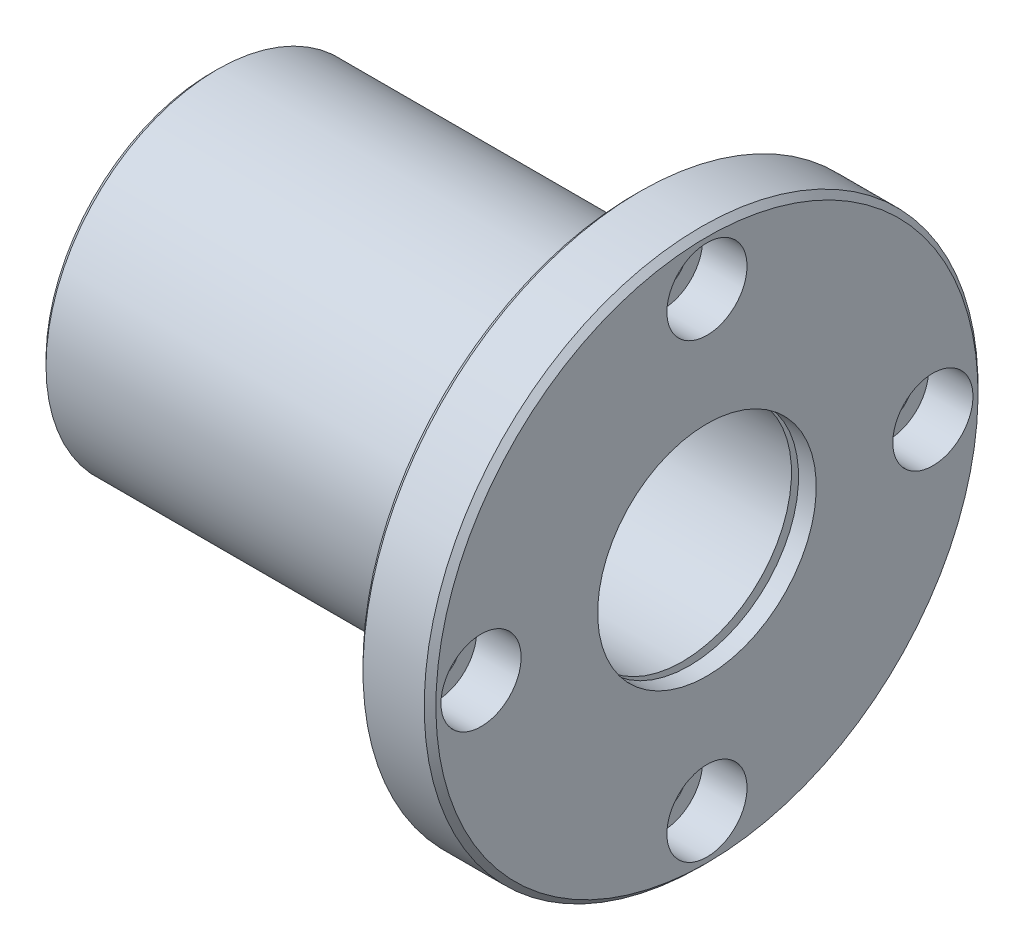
ISO-10303-21;
HEADER;
FILE_DESCRIPTION(('STEP AP214'),'2;1');
FILE_NAME('part.step','',(''),(''),'','','');
FILE_SCHEMA(('AUTOMOTIVE_DESIGN { 1 0 10303 214 1 1 1 1 }'));
ENDSEC;
DATA;
#1=APPLICATION_CONTEXT('core data for automotive mechanical design processes');
#2=APPLICATION_PROTOCOL_DEFINITION('international standard','automotive_design',2000,#1);
#3=PRODUCT_CONTEXT('',#1,'mechanical');
#4=PRODUCT('Part','Part','',(#3));
#5=PRODUCT_RELATED_PRODUCT_CATEGORY('part','',(#4));
#6=PRODUCT_DEFINITION_FORMATION('','',#4);
#7=PRODUCT_DEFINITION_CONTEXT('part definition',#1,'design');
#8=PRODUCT_DEFINITION('design','',#6,#7);
#9=PRODUCT_DEFINITION_SHAPE('','',#8);
#10=(LENGTH_UNIT() NAMED_UNIT(*) SI_UNIT(.MILLI.,.METRE.));
#11=(NAMED_UNIT(*) PLANE_ANGLE_UNIT() SI_UNIT($,.RADIAN.));
#12=(NAMED_UNIT(*) SI_UNIT($,.STERADIAN.) SOLID_ANGLE_UNIT());
#13=UNCERTAINTY_MEASURE_WITH_UNIT(LENGTH_MEASURE(1.E-05),#10,'distance_accuracy_value','');
#14=(GEOMETRIC_REPRESENTATION_CONTEXT(3) GLOBAL_UNCERTAINTY_ASSIGNED_CONTEXT((#13)) GLOBAL_UNIT_ASSIGNED_CONTEXT((#10,
#11,#12)) REPRESENTATION_CONTEXT('',''));
#15=CARTESIAN_POINT('',(0.,0.,0.));
#16=DIRECTION('',(0.,0.,1.));
#17=DIRECTION('',(1.,0.,0.));
#18=AXIS2_PLACEMENT_3D('',#15,#16,#17);
#19=CARTESIAN_POINT('',(0.,19.275,0.));
#20=DIRECTION('',(-1.,0.,0.));
#21=DIRECTION('',(0.,0.,1.));
#22=AXIS2_PLACEMENT_3D('',#19,#20,#21);
#23=PLANE('',#22);
#24=CARTESIAN_POINT('',(0.,0.,0.));
#25=DIRECTION('',(-1.,0.,0.));
#26=DIRECTION('',(0.,1.,0.));
#27=AXIS2_PLACEMENT_3D('',#24,#25,#26);
#28=CIRCLE('',#27,15.85);
#29=CARTESIAN_POINT('',(0.,-15.85,0.));
#30=VERTEX_POINT('',#29);
#31=EDGE_CURVE('E224',#30,#30,#28,.T.);
#32=ORIENTED_EDGE('',*,*,#31,.F.);
#33=EDGE_LOOP('',(#32));
#34=FACE_BOUND('',#33,.T.);
#35=CARTESIAN_POINT('',(0.,0.,0.));
#36=DIRECTION('',(-1.,0.,0.));
#37=DIRECTION('',(0.,1.,0.));
#38=AXIS2_PLACEMENT_3D('',#35,#36,#37);
#39=CIRCLE('',#38,22.7);
#40=CARTESIAN_POINT('',(0.,-22.7,0.));
#41=VERTEX_POINT('',#40);
#42=EDGE_CURVE('E210',#41,#41,#39,.T.);
#43=ORIENTED_EDGE('',*,*,#42,.T.);
#44=EDGE_LOOP('',(#43));
#45=FACE_BOUND('',#44,.T.);
#46=ADVANCED_FACE('F16',(#34,#45),#23,.T.);
#47=CARTESIAN_POINT('',(58.,30.3749155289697,0.));
#48=DIRECTION('',(-1.,0.,0.));
#49=DIRECTION('',(0.,0.,1.));
#50=AXIS2_PLACEMENT_3D('',#47,#48,#49);
#51=PLANE('',#50);
#52=CARTESIAN_POINT('',(58.,0.,0.));
#53=DIRECTION('',(-1.,0.,0.));
#54=DIRECTION('',(0.,1.,0.));
#55=AXIS2_PLACEMENT_3D('',#52,#53,#54);
#56=CIRCLE('',#55,23.5498310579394);
#57=CARTESIAN_POINT('',(58.,23.5498310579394,0.));
#58=VERTEX_POINT('',#57);
#59=CARTESIAN_POINT('',(58.,0.,-23.5498310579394));
#60=VERTEX_POINT('',#59);
#61=EDGE_CURVE('E238',#58,#60,#56,.T.);
#62=ORIENTED_EDGE('',*,*,#61,.F.);
#63=CARTESIAN_POINT('',(58.,0.,0.));
#64=DIRECTION('',(-1.,0.,0.));
#65=DIRECTION('',(0.,1.,0.));
#66=AXIS2_PLACEMENT_3D('',#63,#64,#65);
#67=CIRCLE('',#66,23.5498310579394);
#68=EDGE_CURVE('E232',#60,#58,#67,.T.);
#69=ORIENTED_EDGE('',*,*,#68,.F.);
#70=EDGE_LOOP('',(#62,#69));
#71=FACE_BOUND('',#70,.T.);
#72=CARTESIAN_POINT('',(58.,31.,0.));
#73=DIRECTION('',(1.,0.,0.));
#74=DIRECTION('',(0.,1.,0.));
#75=AXIS2_PLACEMENT_3D('',#72,#73,#74);
#76=CIRCLE('',#75,3.3);
#77=CARTESIAN_POINT('',(58.,27.7,0.));
#78=VERTEX_POINT('',#77);
#79=EDGE_CURVE('E292',#78,#78,#76,.T.);
#80=ORIENTED_EDGE('',*,*,#79,.T.);
#81=EDGE_LOOP('',(#80));
#82=FACE_BOUND('',#81,.T.);
#83=CARTESIAN_POINT('',(58.,-31.,0.));
#84=DIRECTION('',(1.,0.,0.));
#85=DIRECTION('',(0.,1.,0.));
#86=AXIS2_PLACEMENT_3D('',#83,#84,#85);
#87=CIRCLE('',#86,3.3);
#88=CARTESIAN_POINT('',(58.,-34.3,0.));
#89=VERTEX_POINT('',#88);
#90=EDGE_CURVE('E361',#89,#89,#87,.T.);
#91=ORIENTED_EDGE('',*,*,#90,.T.);
#92=EDGE_LOOP('',(#91));
#93=FACE_BOUND('',#92,.T.);
#94=CARTESIAN_POINT('',(58.,0.,31.));
#95=DIRECTION('',(1.,0.,0.));
#96=DIRECTION('',(0.,0.,-1.));
#97=AXIS2_PLACEMENT_3D('',#94,#95,#96);
#98=CIRCLE('',#97,3.3);
#99=CARTESIAN_POINT('',(58.,0.,34.3));
#100=VERTEX_POINT('',#99);
#101=EDGE_CURVE('E274',#100,#100,#98,.T.);
#102=ORIENTED_EDGE('',*,*,#101,.T.);
#103=EDGE_LOOP('',(#102));
#104=FACE_BOUND('',#103,.T.);
#105=CARTESIAN_POINT('',(58.,0.,-31.));
#106=DIRECTION('',(1.,0.,0.));
#107=DIRECTION('',(0.,0.,-1.));
#108=AXIS2_PLACEMENT_3D('',#105,#106,#107);
#109=CIRCLE('',#108,3.3);
#110=CARTESIAN_POINT('',(58.,0.,-27.7));
#111=VERTEX_POINT('',#110);
#112=EDGE_CURVE('E382',#111,#111,#109,.T.);
#113=ORIENTED_EDGE('',*,*,#112,.T.);
#114=EDGE_LOOP('',(#113));
#115=FACE_BOUND('',#114,.T.);
#116=CARTESIAN_POINT('',(58.,0.,0.));
#117=DIRECTION('',(-1.,0.,0.));
#118=DIRECTION('',(0.,1.,0.));
#119=AXIS2_PLACEMENT_3D('',#116,#117,#118);
#120=CIRCLE('',#119,37.2);
#121=CARTESIAN_POINT('',(58.,-37.2,0.));
#122=VERTEX_POINT('',#121);
#123=EDGE_CURVE('E266',#122,#122,#120,.T.);
#124=ORIENTED_EDGE('',*,*,#123,.T.);
#125=EDGE_LOOP('',(#124));
#126=FACE_BOUND('',#125,.T.);
#127=ADVANCED_FACE('F414',(#71,#82,#93,#104,#115,#126),#51,.T.);
#128=CARTESIAN_POINT('',(68.,26.1,0.));
#129=DIRECTION('',(1.,0.,0.));
#130=DIRECTION('',(0.,1.,0.));
#131=AXIS2_PLACEMENT_3D('',#128,#129,#130);
#132=PLANE('',#131);
#133=CARTESIAN_POINT('',(68.,31.,0.));
#134=DIRECTION('',(-1.,0.,0.));
#135=DIRECTION('',(0.,1.,0.));
#136=AXIS2_PLACEMENT_3D('',#133,#134,#135);
#137=CIRCLE('',#136,5.5);
#138=CARTESIAN_POINT('',(68.,25.5,0.));
#139=VERTEX_POINT('',#138);
#140=EDGE_CURVE('E358',#139,#139,#137,.T.);
#141=ORIENTED_EDGE('',*,*,#140,.T.);
#142=EDGE_LOOP('',(#141));
#143=FACE_BOUND('',#142,.T.);
#144=CARTESIAN_POINT('',(68.,-31.,0.));
#145=DIRECTION('',(-1.,0.,0.));
#146=DIRECTION('',(0.,1.,0.));
#147=AXIS2_PLACEMENT_3D('',#144,#145,#146);
#148=CIRCLE('',#147,5.5);
#149=CARTESIAN_POINT('',(68.,-36.5,0.));
#150=VERTEX_POINT('',#149);
#151=EDGE_CURVE('E347',#150,#150,#148,.T.);
#152=ORIENTED_EDGE('',*,*,#151,.T.);
#153=EDGE_LOOP('',(#152));
#154=FACE_BOUND('',#153,.T.);
#155=CARTESIAN_POINT('',(68.,0.,31.));
#156=DIRECTION('',(-1.,0.,0.));
#157=DIRECTION('',(0.,0.,-1.));
#158=AXIS2_PLACEMENT_3D('',#155,#156,#157);
#159=CIRCLE('',#158,5.5);
#160=CARTESIAN_POINT('',(68.,0.,36.5));
#161=VERTEX_POINT('',#160);
#162=EDGE_CURVE('E380',#161,#161,#159,.T.);
#163=ORIENTED_EDGE('',*,*,#162,.T.);
#164=EDGE_LOOP('',(#163));
#165=FACE_BOUND('',#164,.T.);
#166=CARTESIAN_POINT('',(68.,0.,-31.));
#167=DIRECTION('',(-1.,0.,0.));
#168=DIRECTION('',(0.,0.,-1.));
#169=AXIS2_PLACEMENT_3D('',#166,#167,#168);
#170=CIRCLE('',#169,5.5);
#171=CARTESIAN_POINT('',(68.,0.,-25.5));
#172=VERTEX_POINT('',#171);
#173=EDGE_CURVE('E10',#172,#172,#170,.T.);
#174=ORIENTED_EDGE('',*,*,#173,.T.);
#175=EDGE_LOOP('',(#174));
#176=FACE_BOUND('',#175,.T.);
#177=CARTESIAN_POINT('',(68.,0.,0.));
#178=DIRECTION('',(-1.,0.,0.));
#179=DIRECTION('',(0.,1.,0.));
#180=AXIS2_PLACEMENT_3D('',#177,#178,#179);
#181=CIRCLE('',#180,15.);
#182=CARTESIAN_POINT('',(68.,-15.,0.));
#183=VERTEX_POINT('',#182);
#184=EDGE_CURVE('E305',#183,#183,#181,.T.);
#185=ORIENTED_EDGE('',*,*,#184,.T.);
#186=EDGE_LOOP('',(#185));
#187=FACE_BOUND('',#186,.T.);
#188=CARTESIAN_POINT('',(68.,0.,0.));
#189=DIRECTION('',(-1.,0.,0.));
#190=DIRECTION('',(0.,1.,0.));
#191=AXIS2_PLACEMENT_3D('',#188,#189,#190);
#192=CIRCLE('',#191,37.2);
#193=CARTESIAN_POINT('',(68.,-37.2,0.));
#194=VERTEX_POINT('',#193);
#195=EDGE_CURVE('E260',#194,#194,#192,.T.);
#196=ORIENTED_EDGE('',*,*,#195,.F.);
#197=EDGE_LOOP('',(#196));
#198=FACE_BOUND('',#197,.T.);
#199=ADVANCED_FACE('F419',(#143,#154,#165,#176,#187,#198),#132,.T.);
#200=CARTESIAN_POINT('',(65.5714285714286,16.175,0.));
#201=DIRECTION('',(-1.,0.,0.));
#202=DIRECTION('',(0.,0.,1.));
#203=AXIS2_PLACEMENT_3D('',#200,#201,#202);
#204=PLANE('',#203);
#205=CARTESIAN_POINT('',(65.5714285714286,0.,0.));
#206=DIRECTION('',(-1.,0.,0.));
#207=DIRECTION('',(0.,1.,0.));
#208=AXIS2_PLACEMENT_3D('',#205,#206,#207);
#209=CIRCLE('',#208,15.);
#210=CARTESIAN_POINT('',(65.5714285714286,-15.,0.));
#211=VERTEX_POINT('',#210);
#212=EDGE_CURVE('E255',#211,#211,#209,.T.);
#213=ORIENTED_EDGE('',*,*,#212,.F.);
#214=EDGE_LOOP('',(#213));
#215=FACE_BOUND('',#214,.T.);
#216=CARTESIAN_POINT('',(65.5714285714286,0.,0.));
#217=DIRECTION('',(-1.,0.,0.));
#218=DIRECTION('',(0.,1.,0.));
#219=AXIS2_PLACEMENT_3D('',#216,#217,#218);
#220=CIRCLE('',#219,17.35);
#221=CARTESIAN_POINT('',(65.5714285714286,-17.35,0.));
#222=VERTEX_POINT('',#221);
#223=EDGE_CURVE('E225',#222,#222,#220,.T.);
#224=ORIENTED_EDGE('',*,*,#223,.T.);
#225=EDGE_LOOP('',(#224));
#226=FACE_BOUND('',#225,.T.);
#227=ADVANCED_FACE('F893',(#215,#226),#204,.T.);
#228=CARTESIAN_POINT('',(64.6,16.175,0.));
#229=DIRECTION('',(1.,0.,0.));
#230=DIRECTION('',(0.,1.,0.));
#231=AXIS2_PLACEMENT_3D('',#228,#229,#230);
#232=PLANE('',#231);
#233=CARTESIAN_POINT('',(64.6,0.,0.));
#234=DIRECTION('',(-1.,0.,0.));
#235=DIRECTION('',(0.,1.,0.));
#236=AXIS2_PLACEMENT_3D('',#233,#234,#235);
#237=CIRCLE('',#236,15.);
#238=CARTESIAN_POINT('',(64.6,-15.,0.));
#239=VERTEX_POINT('',#238);
#240=EDGE_CURVE('E284',#239,#239,#237,.T.);
#241=ORIENTED_EDGE('',*,*,#240,.T.);
#242=EDGE_LOOP('',(#241));
#243=FACE_BOUND('',#242,.T.);
#244=CARTESIAN_POINT('',(64.6,0.,0.));
#245=DIRECTION('',(-1.,0.,0.));
#246=DIRECTION('',(0.,1.,0.));
#247=AXIS2_PLACEMENT_3D('',#244,#245,#246);
#248=CIRCLE('',#247,17.35);
#249=CARTESIAN_POINT('',(64.6,-17.35,0.));
#250=VERTEX_POINT('',#249);
#251=EDGE_CURVE('E308',#250,#250,#248,.T.);
#252=ORIENTED_EDGE('',*,*,#251,.F.);
#253=EDGE_LOOP('',(#252));
#254=FACE_BOUND('',#253,.T.);
#255=ADVANCED_FACE('F881',(#243,#254),#232,.T.);
#256=CARTESIAN_POINT('',(3.4,16.175,0.));
#257=DIRECTION('',(-1.,0.,0.));
#258=DIRECTION('',(0.,0.,1.));
#259=AXIS2_PLACEMENT_3D('',#256,#257,#258);
#260=PLANE('',#259);
#261=CARTESIAN_POINT('',(3.4,0.,0.));
#262=DIRECTION('',(-1.,0.,0.));
#263=DIRECTION('',(0.,1.,0.));
#264=AXIS2_PLACEMENT_3D('',#261,#262,#263);
#265=CIRCLE('',#264,15.);
#266=CARTESIAN_POINT('',(3.4,-15.,0.));
#267=VERTEX_POINT('',#266);
#268=EDGE_CURVE('E228',#267,#267,#265,.T.);
#269=ORIENTED_EDGE('',*,*,#268,.F.);
#270=EDGE_LOOP('',(#269));
#271=FACE_BOUND('',#270,.T.);
#272=CARTESIAN_POINT('',(3.4,0.,0.));
#273=DIRECTION('',(-1.,0.,0.));
#274=DIRECTION('',(0.,1.,0.));
#275=AXIS2_PLACEMENT_3D('',#272,#273,#274);
#276=CIRCLE('',#275,17.35);
#277=CARTESIAN_POINT('',(3.4,-17.35,0.));
#278=VERTEX_POINT('',#277);
#279=EDGE_CURVE('E243',#278,#278,#276,.T.);
#280=ORIENTED_EDGE('',*,*,#279,.T.);
#281=EDGE_LOOP('',(#280));
#282=FACE_BOUND('',#281,.T.);
#283=ADVANCED_FACE('F684',(#271,#282),#260,.T.);
#284=CARTESIAN_POINT('',(2.42857142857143,16.6,0.));
#285=DIRECTION('',(1.,0.,0.));
#286=DIRECTION('',(0.,1.,0.));
#287=AXIS2_PLACEMENT_3D('',#284,#285,#286);
#288=PLANE('',#287);
#289=CARTESIAN_POINT('',(2.42857142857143,0.,0.));
#290=DIRECTION('',(-1.,0.,0.));
#291=DIRECTION('',(0.,1.,0.));
#292=AXIS2_PLACEMENT_3D('',#289,#290,#291);
#293=CIRCLE('',#292,15.85);
#294=CARTESIAN_POINT('',(2.42857142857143,-15.85,0.));
#295=VERTEX_POINT('',#294);
#296=EDGE_CURVE('E223',#295,#295,#293,.T.);
#297=ORIENTED_EDGE('',*,*,#296,.T.);
#298=EDGE_LOOP('',(#297));
#299=FACE_BOUND('',#298,.T.);
#300=CARTESIAN_POINT('',(2.42857142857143,0.,0.));
#301=DIRECTION('',(-1.,0.,0.));
#302=DIRECTION('',(0.,1.,0.));
#303=AXIS2_PLACEMENT_3D('',#300,#301,#302);
#304=CIRCLE('',#303,17.35);
#305=CARTESIAN_POINT('',(2.42857142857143,-17.35,0.));
#306=VERTEX_POINT('',#305);
#307=EDGE_CURVE('E244',#306,#306,#304,.T.);
#308=ORIENTED_EDGE('',*,*,#307,.F.);
#309=EDGE_LOOP('',(#308));
#310=FACE_BOUND('',#309,.T.);
#311=ADVANCED_FACE('F679',(#299,#310),#288,.T.);
#312=CARTESIAN_POINT('',(61.9,35.4,0.));
#313=DIRECTION('',(-1.,0.,0.));
#314=DIRECTION('',(0.,0.,1.));
#315=AXIS2_PLACEMENT_3D('',#312,#313,#314);
#316=PLANE('',#315);
#317=CARTESIAN_POINT('',(61.9,31.,0.));
#318=DIRECTION('',(-1.,0.,0.));
#319=DIRECTION('',(0.,1.,0.));
#320=AXIS2_PLACEMENT_3D('',#317,#318,#319);
#321=CIRCLE('',#320,3.3);
#322=CARTESIAN_POINT('',(61.9,27.7,0.));
#323=VERTEX_POINT('',#322);
#324=EDGE_CURVE('E343',#323,#323,#321,.T.);
#325=ORIENTED_EDGE('',*,*,#324,.T.);
#326=EDGE_LOOP('',(#325));
#327=FACE_BOUND('',#326,.T.);
#328=CARTESIAN_POINT('',(61.9,31.,0.));
#329=DIRECTION('',(-1.,0.,0.));
#330=DIRECTION('',(0.,1.,0.));
#331=AXIS2_PLACEMENT_3D('',#328,#329,#330);
#332=CIRCLE('',#331,5.5);
#333=CARTESIAN_POINT('',(61.9,25.5,0.));
#334=VERTEX_POINT('',#333);
#335=EDGE_CURVE('E350',#334,#334,#332,.T.);
#336=ORIENTED_EDGE('',*,*,#335,.F.);
#337=EDGE_LOOP('',(#336));
#338=FACE_BOUND('',#337,.T.);
#339=ADVANCED_FACE('F601',(#327,#338),#316,.F.);
#340=CARTESIAN_POINT('',(61.9,-26.6,0.));
#341=DIRECTION('',(-1.,0.,0.));
#342=DIRECTION('',(0.,0.,1.));
#343=AXIS2_PLACEMENT_3D('',#340,#341,#342);
#344=PLANE('',#343);
#345=CARTESIAN_POINT('',(61.9,-31.,0.));
#346=DIRECTION('',(-1.,0.,0.));
#347=DIRECTION('',(0.,1.,0.));
#348=AXIS2_PLACEMENT_3D('',#345,#346,#347);
#349=CIRCLE('',#348,3.3);
#350=CARTESIAN_POINT('',(61.9,-34.3,0.));
#351=VERTEX_POINT('',#350);
#352=EDGE_CURVE('E319',#351,#351,#349,.T.);
#353=ORIENTED_EDGE('',*,*,#352,.T.);
#354=EDGE_LOOP('',(#353));
#355=FACE_BOUND('',#354,.T.);
#356=CARTESIAN_POINT('',(61.9,-31.,0.));
#357=DIRECTION('',(-1.,0.,0.));
#358=DIRECTION('',(0.,1.,0.));
#359=AXIS2_PLACEMENT_3D('',#356,#357,#358);
#360=CIRCLE('',#359,5.5);
#361=CARTESIAN_POINT('',(61.9,-36.5,0.));
#362=VERTEX_POINT('',#361);
#363=EDGE_CURVE('E322',#362,#362,#360,.T.);
#364=ORIENTED_EDGE('',*,*,#363,.F.);
#365=EDGE_LOOP('',(#364));
#366=FACE_BOUND('',#365,.T.);
#367=ADVANCED_FACE('F595',(#355,#366),#344,.F.);
#368=CARTESIAN_POINT('',(61.9,0.,26.6));
#369=DIRECTION('',(-1.,0.,0.));
#370=DIRECTION('',(0.,0.,1.));
#371=AXIS2_PLACEMENT_3D('',#368,#369,#370);
#372=PLANE('',#371);
#373=CARTESIAN_POINT('',(61.9,0.,31.));
#374=DIRECTION('',(-1.,0.,0.));
#375=DIRECTION('',(0.,0.,-1.));
#376=AXIS2_PLACEMENT_3D('',#373,#374,#375);
#377=CIRCLE('',#376,3.3);
#378=CARTESIAN_POINT('',(61.9,0.,34.3));
#379=VERTEX_POINT('',#378);
#380=EDGE_CURVE('E250',#379,#379,#377,.T.);
#381=ORIENTED_EDGE('',*,*,#380,.T.);
#382=EDGE_LOOP('',(#381));
#383=FACE_BOUND('',#382,.T.);
#384=CARTESIAN_POINT('',(61.9,0.,31.));
#385=DIRECTION('',(-1.,0.,0.));
#386=DIRECTION('',(0.,0.,-1.));
#387=AXIS2_PLACEMENT_3D('',#384,#385,#386);
#388=CIRCLE('',#387,5.5);
#389=CARTESIAN_POINT('',(61.9,0.,36.5));
#390=VERTEX_POINT('',#389);
#391=EDGE_CURVE('E253',#390,#390,#388,.T.);
#392=ORIENTED_EDGE('',*,*,#391,.F.);
#393=EDGE_LOOP('',(#392));
#394=FACE_BOUND('',#393,.T.);
#395=ADVANCED_FACE('F409',(#383,#394),#372,.F.);
#396=CARTESIAN_POINT('',(61.9,0.,-35.4));
#397=DIRECTION('',(-1.,0.,0.));
#398=DIRECTION('',(0.,0.,1.));
#399=AXIS2_PLACEMENT_3D('',#396,#397,#398);
#400=PLANE('',#399);
#401=CARTESIAN_POINT('',(61.9,0.,-31.));
#402=DIRECTION('',(-1.,0.,0.));
#403=DIRECTION('',(0.,0.,-1.));
#404=AXIS2_PLACEMENT_3D('',#401,#402,#403);
#405=CIRCLE('',#404,3.3);
#406=CARTESIAN_POINT('',(61.9,0.,-27.7));
#407=VERTEX_POINT('',#406);
#408=EDGE_CURVE('E214',#407,#407,#405,.T.);
#409=ORIENTED_EDGE('',*,*,#408,.T.);
#410=EDGE_LOOP('',(#409));
#411=FACE_BOUND('',#410,.T.);
#412=CARTESIAN_POINT('',(61.9,0.,-31.));
#413=DIRECTION('',(-1.,0.,0.));
#414=DIRECTION('',(0.,0.,-1.));
#415=AXIS2_PLACEMENT_3D('',#412,#413,#414);
#416=CIRCLE('',#415,5.5);
#417=CARTESIAN_POINT('',(61.9,0.,-25.5));
#418=VERTEX_POINT('',#417);
#419=EDGE_CURVE('E216',#418,#418,#416,.T.);
#420=ORIENTED_EDGE('',*,*,#419,.F.);
#421=EDGE_LOOP('',(#420));
#422=FACE_BOUND('',#421,.T.);
#423=ADVANCED_FACE('F399',(#411,#422),#400,.F.);
#424=CARTESIAN_POINT('',(64.95,0.,-31.));
#425=DIRECTION('',(1.,0.,0.));
#426=DIRECTION('',(0.,0.,-1.));
#427=AXIS2_PLACEMENT_3D('',#424,#425,#426);
#428=CYLINDRICAL_SURFACE('',#427,5.5);
#429=ORIENTED_EDGE('',*,*,#419,.T.);
#430=DIRECTION('',(1.,0.,0.));
#431=VECTOR('',#430,1.);
#432=CARTESIAN_POINT('',(64.95,0.,-25.5));
#433=LINE('',#432,#431);
#434=EDGE_CURVE('E19',#418,#172,#433,.T.);
#435=ORIENTED_EDGE('',*,*,#434,.T.);
#436=ORIENTED_EDGE('',*,*,#173,.F.);
#437=ORIENTED_EDGE('',*,*,#434,.F.);
#438=EDGE_LOOP('',(#429,#435,#436,#437));
#439=FACE_BOUND('',#438,.T.);
#440=ADVANCED_FACE('F396',(#439),#428,.F.);
#441=CARTESIAN_POINT('',(59.95,0.,-31.));
#442=DIRECTION('',(1.,0.,0.));
#443=DIRECTION('',(0.,0.,-1.));
#444=AXIS2_PLACEMENT_3D('',#441,#442,#443);
#445=CYLINDRICAL_SURFACE('',#444,3.3);
#446=ORIENTED_EDGE('',*,*,#112,.F.);
#447=DIRECTION('',(1.,0.,0.));
#448=VECTOR('',#447,1.);
#449=CARTESIAN_POINT('',(59.95,0.,-27.7));
#450=LINE('',#449,#448);
#451=EDGE_CURVE('E217',#111,#407,#450,.T.);
#452=ORIENTED_EDGE('',*,*,#451,.T.);
#453=ORIENTED_EDGE('',*,*,#408,.F.);
#454=ORIENTED_EDGE('',*,*,#451,.F.);
#455=EDGE_LOOP('',(#446,#452,#453,#454));
#456=FACE_BOUND('',#455,.T.);
#457=ADVANCED_FACE('F398',(#456),#445,.F.);
#458=CARTESIAN_POINT('',(64.95,0.,31.));
#459=DIRECTION('',(1.,0.,0.));
#460=DIRECTION('',(0.,0.,-1.));
#461=AXIS2_PLACEMENT_3D('',#458,#459,#460);
#462=CYLINDRICAL_SURFACE('',#461,5.5);
#463=ORIENTED_EDGE('',*,*,#391,.T.);
#464=DIRECTION('',(1.,0.,0.));
#465=VECTOR('',#464,1.);
#466=CARTESIAN_POINT('',(64.95,0.,36.5));
#467=LINE('',#466,#465);
#468=EDGE_CURVE('E376',#390,#161,#467,.T.);
#469=ORIENTED_EDGE('',*,*,#468,.T.);
#470=ORIENTED_EDGE('',*,*,#162,.F.);
#471=ORIENTED_EDGE('',*,*,#468,.F.);
#472=EDGE_LOOP('',(#463,#469,#470,#471));
#473=FACE_BOUND('',#472,.T.);
#474=ADVANCED_FACE('F406',(#473),#462,.F.);
#475=CARTESIAN_POINT('',(59.95,0.,31.));
#476=DIRECTION('',(1.,0.,0.));
#477=DIRECTION('',(0.,0.,-1.));
#478=AXIS2_PLACEMENT_3D('',#475,#476,#477);
#479=CYLINDRICAL_SURFACE('',#478,3.3);
#480=ORIENTED_EDGE('',*,*,#101,.F.);
#481=DIRECTION('',(1.,0.,0.));
#482=VECTOR('',#481,1.);
#483=CARTESIAN_POINT('',(59.95,0.,34.3));
#484=LINE('',#483,#482);
#485=EDGE_CURVE('E254',#100,#379,#484,.T.);
#486=ORIENTED_EDGE('',*,*,#485,.T.);
#487=ORIENTED_EDGE('',*,*,#380,.F.);
#488=ORIENTED_EDGE('',*,*,#485,.F.);
#489=EDGE_LOOP('',(#480,#486,#487,#488));
#490=FACE_BOUND('',#489,.T.);
#491=ADVANCED_FACE('F806',(#490),#479,.F.);
#492=CARTESIAN_POINT('',(64.95,-31.,0.));
#493=DIRECTION('',(1.,0.,0.));
#494=DIRECTION('',(0.,1.,0.));
#495=AXIS2_PLACEMENT_3D('',#492,#493,#494);
#496=CYLINDRICAL_SURFACE('',#495,5.5);
#497=ORIENTED_EDGE('',*,*,#363,.T.);
#498=DIRECTION('',(1.,0.,0.));
#499=VECTOR('',#498,1.);
#500=CARTESIAN_POINT('',(64.95,-36.5,0.));
#501=LINE('',#500,#499);
#502=EDGE_CURVE('E330',#362,#150,#501,.T.);
#503=ORIENTED_EDGE('',*,*,#502,.T.);
#504=ORIENTED_EDGE('',*,*,#151,.F.);
#505=ORIENTED_EDGE('',*,*,#502,.F.);
#506=EDGE_LOOP('',(#497,#503,#504,#505));
#507=FACE_BOUND('',#506,.T.);
#508=ADVANCED_FACE('F751',(#507),#496,.F.);
#509=CARTESIAN_POINT('',(59.95,-31.,0.));
#510=DIRECTION('',(1.,0.,0.));
#511=DIRECTION('',(0.,1.,0.));
#512=AXIS2_PLACEMENT_3D('',#509,#510,#511);
#513=CYLINDRICAL_SURFACE('',#512,3.3);
#514=ORIENTED_EDGE('',*,*,#90,.F.);
#515=DIRECTION('',(1.,0.,0.));
#516=VECTOR('',#515,1.);
#517=CARTESIAN_POINT('',(59.95,-34.3,0.));
#518=LINE('',#517,#516);
#519=EDGE_CURVE('E323',#89,#351,#518,.T.);
#520=ORIENTED_EDGE('',*,*,#519,.T.);
#521=ORIENTED_EDGE('',*,*,#352,.F.);
#522=ORIENTED_EDGE('',*,*,#519,.F.);
#523=EDGE_LOOP('',(#514,#520,#521,#522));
#524=FACE_BOUND('',#523,.T.);
#525=ADVANCED_FACE('F745',(#524),#513,.F.);
#526=CARTESIAN_POINT('',(64.95,31.,0.));
#527=DIRECTION('',(1.,0.,0.));
#528=DIRECTION('',(0.,1.,0.));
#529=AXIS2_PLACEMENT_3D('',#526,#527,#528);
#530=CYLINDRICAL_SURFACE('',#529,5.5);
#531=ORIENTED_EDGE('',*,*,#335,.T.);
#532=DIRECTION('',(1.,0.,0.));
#533=VECTOR('',#532,1.);
#534=CARTESIAN_POINT('',(64.95,25.5,0.));
#535=LINE('',#534,#533);
#536=EDGE_CURVE('E354',#334,#139,#535,.T.);
#537=ORIENTED_EDGE('',*,*,#536,.T.);
#538=ORIENTED_EDGE('',*,*,#140,.F.);
#539=ORIENTED_EDGE('',*,*,#536,.F.);
#540=EDGE_LOOP('',(#531,#537,#538,#539));
#541=FACE_BOUND('',#540,.T.);
#542=ADVANCED_FACE('F750',(#541),#530,.F.);
#543=CARTESIAN_POINT('',(59.95,31.,0.));
#544=DIRECTION('',(1.,0.,0.));
#545=DIRECTION('',(0.,1.,0.));
#546=AXIS2_PLACEMENT_3D('',#543,#544,#545);
#547=CYLINDRICAL_SURFACE('',#546,3.3);
#548=ORIENTED_EDGE('',*,*,#79,.F.);
#549=DIRECTION('',(1.,0.,0.));
#550=VECTOR('',#549,1.);
#551=CARTESIAN_POINT('',(59.95,27.7,0.));
#552=LINE('',#551,#550);
#553=EDGE_CURVE('E296',#78,#323,#552,.T.);
#554=ORIENTED_EDGE('',*,*,#553,.T.);
#555=ORIENTED_EDGE('',*,*,#324,.F.);
#556=ORIENTED_EDGE('',*,*,#553,.F.);
#557=EDGE_LOOP('',(#548,#554,#555,#556));
#558=FACE_BOUND('',#557,.T.);
#559=ADVANCED_FACE('F761',(#558),#547,.F.);
#560=CARTESIAN_POINT('',(1.21428571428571,0.,0.));
#561=DIRECTION('',(1.,0.,0.));
#562=DIRECTION('',(0.,1.,0.));
#563=AXIS2_PLACEMENT_3D('',#560,#561,#562);
#564=CYLINDRICAL_SURFACE('',#563,15.85);
#565=ORIENTED_EDGE('',*,*,#31,.T.);
#566=DIRECTION('',(1.,0.,0.));
#567=VECTOR('',#566,1.);
#568=CARTESIAN_POINT('',(1.21428571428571,-15.85,0.));
#569=LINE('',#568,#567);
#570=EDGE_CURVE('E219',#30,#295,#569,.T.);
#571=ORIENTED_EDGE('',*,*,#570,.T.);
#572=ORIENTED_EDGE('',*,*,#296,.F.);
#573=ORIENTED_EDGE('',*,*,#570,.F.);
#574=EDGE_LOOP('',(#565,#571,#572,#573));
#575=FACE_BOUND('',#574,.T.);
#576=ADVANCED_FACE('F658',(#575),#564,.F.);
#577=CARTESIAN_POINT('',(2.91428571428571,0.,0.));
#578=DIRECTION('',(1.,0.,0.));
#579=DIRECTION('',(0.,1.,0.));
#580=AXIS2_PLACEMENT_3D('',#577,#578,#579);
#581=CYLINDRICAL_SURFACE('',#580,17.35);
#582=ORIENTED_EDGE('',*,*,#307,.T.);
#583=DIRECTION('',(1.,0.,0.));
#584=VECTOR('',#583,1.);
#585=CARTESIAN_POINT('',(2.91428571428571,-17.35,0.));
#586=LINE('',#585,#584);
#587=EDGE_CURVE('E239',#306,#278,#586,.T.);
#588=ORIENTED_EDGE('',*,*,#587,.T.);
#589=ORIENTED_EDGE('',*,*,#279,.F.);
#590=ORIENTED_EDGE('',*,*,#587,.F.);
#591=EDGE_LOOP('',(#582,#588,#589,#590));
#592=FACE_BOUND('',#591,.T.);
#593=ADVANCED_FACE('F652',(#592),#581,.F.);
#594=CARTESIAN_POINT('',(34.,0.,0.));
#595=DIRECTION('',(1.,0.,0.));
#596=DIRECTION('',(0.,1.,0.));
#597=AXIS2_PLACEMENT_3D('',#594,#595,#596);
#598=CYLINDRICAL_SURFACE('',#597,15.);
#599=ORIENTED_EDGE('',*,*,#268,.T.);
#600=DIRECTION('',(1.,0.,0.));
#601=VECTOR('',#600,1.);
#602=CARTESIAN_POINT('',(34.,-15.,0.));
#603=LINE('',#602,#601);
#604=EDGE_CURVE('E318',#267,#239,#603,.T.);
#605=ORIENTED_EDGE('',*,*,#604,.T.);
#606=ORIENTED_EDGE('',*,*,#240,.F.);
#607=ORIENTED_EDGE('',*,*,#604,.F.);
#608=EDGE_LOOP('',(#599,#605,#606,#607));
#609=FACE_BOUND('',#608,.T.);
#610=ADVANCED_FACE('F657',(#609),#598,.F.);
#611=CARTESIAN_POINT('',(65.0857142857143,0.,0.));
#612=DIRECTION('',(1.,0.,0.));
#613=DIRECTION('',(0.,1.,0.));
#614=AXIS2_PLACEMENT_3D('',#611,#612,#613);
#615=CYLINDRICAL_SURFACE('',#614,17.35);
#616=ORIENTED_EDGE('',*,*,#251,.T.);
#617=DIRECTION('',(1.,0.,0.));
#618=VECTOR('',#617,1.);
#619=CARTESIAN_POINT('',(65.0857142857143,-17.35,0.));
#620=LINE('',#619,#618);
#621=EDGE_CURVE('E229',#250,#222,#620,.T.);
#622=ORIENTED_EDGE('',*,*,#621,.T.);
#623=ORIENTED_EDGE('',*,*,#223,.F.);
#624=ORIENTED_EDGE('',*,*,#621,.F.);
#625=EDGE_LOOP('',(#616,#622,#623,#624));
#626=FACE_BOUND('',#625,.T.);
#627=ADVANCED_FACE('F707',(#626),#615,.F.);
#628=CARTESIAN_POINT('',(66.7857142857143,0.,0.));
#629=DIRECTION('',(1.,0.,0.));
#630=DIRECTION('',(0.,1.,0.));
#631=AXIS2_PLACEMENT_3D('',#628,#629,#630);
#632=CYLINDRICAL_SURFACE('',#631,15.);
#633=ORIENTED_EDGE('',*,*,#212,.T.);
#634=DIRECTION('',(1.,0.,0.));
#635=VECTOR('',#634,1.);
#636=CARTESIAN_POINT('',(66.7857142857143,-15.,0.));
#637=LINE('',#636,#635);
#638=EDGE_CURVE('E259',#211,#183,#637,.T.);
#639=ORIENTED_EDGE('',*,*,#638,.T.);
#640=ORIENTED_EDGE('',*,*,#184,.F.);
#641=ORIENTED_EDGE('',*,*,#638,.F.);
#642=EDGE_LOOP('',(#633,#639,#640,#641));
#643=FACE_BOUND('',#642,.T.);
#644=ADVANCED_FACE('F630',(#643),#632,.F.);
#645=CARTESIAN_POINT('',(67.6,0.,0.));
#646=DIRECTION('',(-1.,0.,0.));
#647=DIRECTION('',(0.,1.,0.));
#648=AXIS2_PLACEMENT_3D('',#645,#646,#647);
#649=CONICAL_SURFACE('',#648,37.6,0.785398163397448);
#650=CARTESIAN_POINT('',(67.2,0.,0.));
#651=DIRECTION('',(-1.,0.,0.));
#652=DIRECTION('',(0.,1.,0.));
#653=AXIS2_PLACEMENT_3D('',#650,#651,#652);
#654=CIRCLE('',#653,38.);
#655=CARTESIAN_POINT('',(67.2,-38.,0.));
#656=VERTEX_POINT('',#655);
#657=EDGE_CURVE('E269',#656,#656,#654,.T.);
#658=ORIENTED_EDGE('',*,*,#657,.F.);
#659=DIRECTION('',(0.707106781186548,0.707106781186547,0.));
#660=VECTOR('',#659,1.);
#661=CARTESIAN_POINT('',(67.6,-37.6,0.));
#662=LINE('',#661,#660);
#663=EDGE_CURVE('E288',#656,#194,#662,.T.);
#664=ORIENTED_EDGE('',*,*,#663,.T.);
#665=ORIENTED_EDGE('',*,*,#195,.T.);
#666=ORIENTED_EDGE('',*,*,#663,.F.);
#667=EDGE_LOOP('',(#658,#664,#665,#666));
#668=FACE_BOUND('',#667,.T.);
#669=ADVANCED_FACE('F624',(#668),#649,.T.);
#670=CARTESIAN_POINT('',(63.,0.,0.));
#671=DIRECTION('',(1.,0.,0.));
#672=DIRECTION('',(0.,1.,0.));
#673=AXIS2_PLACEMENT_3D('',#670,#671,#672);
#674=CYLINDRICAL_SURFACE('',#673,38.);
#675=ORIENTED_EDGE('',*,*,#657,.T.);
#676=DIRECTION('',(-1.,0.,0.));
#677=VECTOR('',#676,1.);
#678=CARTESIAN_POINT('',(63.,-38.,0.));
#679=LINE('',#678,#677);
#680=CARTESIAN_POINT('',(58.8,-38.,0.));
#681=VERTEX_POINT('',#680);
#682=EDGE_CURVE('E285',#656,#681,#679,.T.);
#683=ORIENTED_EDGE('',*,*,#682,.T.);
#684=CARTESIAN_POINT('',(58.8,0.,0.));
#685=DIRECTION('',(-1.,0.,0.));
#686=DIRECTION('',(0.,1.,0.));
#687=AXIS2_PLACEMENT_3D('',#684,#685,#686);
#688=CIRCLE('',#687,38.);
#689=EDGE_CURVE('E193',#681,#681,#688,.T.);
#690=ORIENTED_EDGE('',*,*,#689,.F.);
#691=ORIENTED_EDGE('',*,*,#682,.F.);
#692=EDGE_LOOP('',(#675,#683,#690,#691));
#693=FACE_BOUND('',#692,.T.);
#694=ADVANCED_FACE('F629',(#693),#674,.T.);
#695=CARTESIAN_POINT('',(58.4,0.,0.));
#696=DIRECTION('',(1.,0.,0.));
#697=DIRECTION('',(0.,1.,0.));
#698=AXIS2_PLACEMENT_3D('',#695,#696,#697);
#699=CONICAL_SURFACE('',#698,37.6,0.785398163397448);
#700=ORIENTED_EDGE('',*,*,#689,.T.);
#701=DIRECTION('',(-0.707106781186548,0.707106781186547,0.));
#702=VECTOR('',#701,1.);
#703=CARTESIAN_POINT('',(58.4,-37.6,0.));
#704=LINE('',#703,#702);
#705=EDGE_CURVE('E270',#681,#122,#704,.T.);
#706=ORIENTED_EDGE('',*,*,#705,.T.);
#707=ORIENTED_EDGE('',*,*,#123,.F.);
#708=ORIENTED_EDGE('',*,*,#705,.F.);
#709=EDGE_LOOP('',(#700,#706,#707,#708));
#710=FACE_BOUND('',#709,.T.);
#711=ADVANCED_FACE('F643',(#710),#699,.T.);
#712=CARTESIAN_POINT('',(56.1310621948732,0.,0.));
#713=DIRECTION('',(-1.,0.,0.));
#714=DIRECTION('',(0.,1.,0.));
#715=AXIS2_PLACEMENT_3D('',#712,#713,#714);
#716=CONICAL_SURFACE('',#715,23.2329436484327,0.23186466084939);
#717=CARTESIAN_POINT('',(55.,0.,0.));
#718=DIRECTION('',(-1.,0.,0.));
#719=DIRECTION('',(0.,1.,0.));
#720=AXIS2_PLACEMENT_3D('',#717,#718,#719);
#721=CIRCLE('',#720,23.5);
#722=CARTESIAN_POINT('',(55.,-23.5,0.));
#723=VERTEX_POINT('',#722);
#724=EDGE_CURVE('E190',#723,#723,#721,.T.);
#725=ORIENTED_EDGE('',*,*,#724,.F.);
#726=DIRECTION('',(0.973239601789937,0.229792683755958,0.));
#727=VECTOR('',#726,1.);
#728=CARTESIAN_POINT('',(56.1310621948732,-23.2329436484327,0.));
#729=LINE('',#728,#727);
#730=CARTESIAN_POINT('',(57.2621243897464,-22.9658872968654,0.));
#731=VERTEX_POINT('',#730);
#732=EDGE_CURVE('E184',#723,#731,#729,.T.);
#733=ORIENTED_EDGE('',*,*,#732,.T.);
#734=CARTESIAN_POINT('',(57.2621243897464,0.,0.));
#735=DIRECTION('',(-1.,0.,0.));
#736=DIRECTION('',(0.,1.,0.));
#737=AXIS2_PLACEMENT_3D('',#734,#735,#736);
#738=CIRCLE('',#737,22.9658872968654);
#739=CARTESIAN_POINT('',(57.2621243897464,0.,-22.9658872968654));
#740=VERTEX_POINT('',#739);
#741=EDGE_CURVE('E188',#731,#740,#738,.T.);
#742=ORIENTED_EDGE('',*,*,#741,.T.);
#743=CARTESIAN_POINT('',(57.2621243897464,0.,0.));
#744=DIRECTION('',(-1.,0.,0.));
#745=DIRECTION('',(0.,1.,0.));
#746=AXIS2_PLACEMENT_3D('',#743,#744,#745);
#747=CIRCLE('',#746,22.9658872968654);
#748=EDGE_CURVE('E197',#740,#731,#747,.T.);
#749=ORIENTED_EDGE('',*,*,#748,.T.);
#750=ORIENTED_EDGE('',*,*,#732,.F.);
#751=EDGE_LOOP('',(#725,#733,#742,#749,#750));
#752=FACE_BOUND('',#751,.T.);
#753=ADVANCED_FACE('F186',(#752),#716,.T.);
#754=CARTESIAN_POINT('',(27.9,0.,0.));
#755=DIRECTION('',(1.,0.,0.));
#756=DIRECTION('',(0.,1.,0.));
#757=AXIS2_PLACEMENT_3D('',#754,#755,#756);
#758=CYLINDRICAL_SURFACE('',#757,23.5);
#759=ORIENTED_EDGE('',*,*,#724,.T.);
#760=DIRECTION('',(-1.,0.,0.));
#761=VECTOR('',#760,1.);
#762=CARTESIAN_POINT('',(27.9,-23.5,0.));
#763=LINE('',#762,#761);
#764=CARTESIAN_POINT('',(0.8,-23.5,0.));
#765=VERTEX_POINT('',#764);
#766=EDGE_CURVE('E194',#723,#765,#763,.T.);
#767=ORIENTED_EDGE('',*,*,#766,.T.);
#768=CARTESIAN_POINT('',(0.8,0.,0.));
#769=DIRECTION('',(-1.,0.,0.));
#770=DIRECTION('',(0.,1.,0.));
#771=AXIS2_PLACEMENT_3D('',#768,#769,#770);
#772=CIRCLE('',#771,23.5);
#773=EDGE_CURVE('E233',#765,#765,#772,.T.);
#774=ORIENTED_EDGE('',*,*,#773,.F.);
#775=ORIENTED_EDGE('',*,*,#766,.F.);
#776=EDGE_LOOP('',(#759,#767,#774,#775));
#777=FACE_BOUND('',#776,.T.);
#778=ADVANCED_FACE('F671',(#777),#758,.T.);
#779=CARTESIAN_POINT('',(0.4,0.,0.));
#780=DIRECTION('',(1.,0.,0.));
#781=DIRECTION('',(0.,1.,0.));
#782=AXIS2_PLACEMENT_3D('',#779,#780,#781);
#783=CONICAL_SURFACE('',#782,23.1,0.785398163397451);
#784=ORIENTED_EDGE('',*,*,#773,.T.);
#785=DIRECTION('',(-0.707106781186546,0.70710678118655,0.));
#786=VECTOR('',#785,1.);
#787=CARTESIAN_POINT('',(0.4,-23.1,0.));
#788=LINE('',#787,#786);
#789=EDGE_CURVE('E237',#765,#41,#788,.T.);
#790=ORIENTED_EDGE('',*,*,#789,.T.);
#791=ORIENTED_EDGE('',*,*,#42,.F.);
#792=ORIENTED_EDGE('',*,*,#789,.F.);
#793=EDGE_LOOP('',(#784,#790,#791,#792));
#794=FACE_BOUND('',#793,.T.);
#795=ADVANCED_FACE('F616',(#794),#783,.T.);
#796=CARTESIAN_POINT('',(57.4,0.,0.));
#797=DIRECTION('',(-1.,0.,0.));
#798=DIRECTION('',(0.,0.,1.));
#799=AXIS2_PLACEMENT_3D('',#796,#797,#798);
#800=TOROIDAL_SURFACE('',#799,23.5498310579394,0.6);
#801=ORIENTED_EDGE('',*,*,#741,.F.);
#802=ORIENTED_EDGE('',*,*,#748,.F.);
#803=CARTESIAN_POINT('',(57.4,0.,-23.5498310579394));
#804=DIRECTION('',(0.,1.,0.));
#805=DIRECTION('',(0.,0.,-1.));
#806=AXIS2_PLACEMENT_3D('',#803,#804,#805);
#807=CIRCLE('',#806,0.6);
#808=EDGE_CURVE('E201',#740,#60,#807,.T.);
#809=ORIENTED_EDGE('',*,*,#808,.T.);
#810=ORIENTED_EDGE('',*,*,#68,.T.);
#811=ORIENTED_EDGE('',*,*,#61,.T.);
#812=ORIENTED_EDGE('',*,*,#808,.F.);
#813=EDGE_LOOP('',(#801,#802,#809,#810,#811,#812));
#814=FACE_BOUND('',#813,.T.);
#815=ADVANCED_FACE('F203',(#814),#800,.F.);
#816=CLOSED_SHELL('',(#46,#127,#199,#227,#255,#283,#311,#339,#367,#395,#423,#440,#457,#474,#491,
#508,#525,#542,#559,#576,#593,#610,#627,#644,#669,#694,#711,#753,#778,#795,#815));
#817=MANIFOLD_SOLID_BREP('B1',#816);
#818=ADVANCED_BREP_SHAPE_REPRESENTATION('',(#18,#817),#14);
#819=SHAPE_DEFINITION_REPRESENTATION(#9,#818);
ENDSEC;
END-ISO-10303-21;
